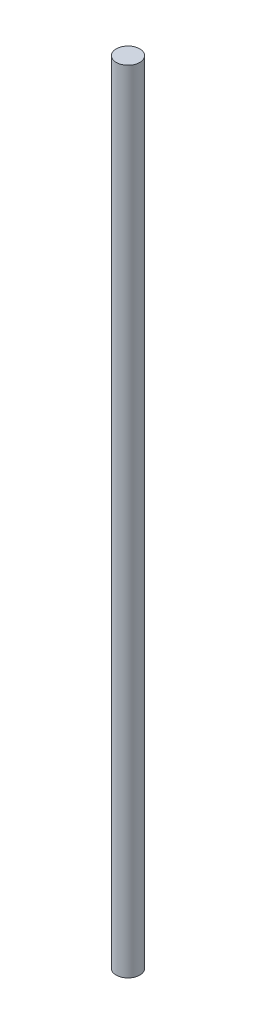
ISO-10303-21;
HEADER;
FILE_DESCRIPTION(('STEP AP214'),'2;1');
FILE_NAME('part.step','',(''),(''),'','','');
FILE_SCHEMA(('AUTOMOTIVE_DESIGN { 1 0 10303 214 1 1 1 1 }'));
ENDSEC;
DATA;
#1=APPLICATION_CONTEXT('core data for automotive mechanical design processes');
#2=APPLICATION_PROTOCOL_DEFINITION('international standard','automotive_design',2000,#1);
#3=PRODUCT_CONTEXT('',#1,'mechanical');
#4=PRODUCT('Part','Part','',(#3));
#5=PRODUCT_RELATED_PRODUCT_CATEGORY('part','',(#4));
#6=PRODUCT_DEFINITION_FORMATION('','',#4);
#7=PRODUCT_DEFINITION_CONTEXT('part definition',#1,'design');
#8=PRODUCT_DEFINITION('design','',#6,#7);
#9=PRODUCT_DEFINITION_SHAPE('','',#8);
#10=(LENGTH_UNIT() NAMED_UNIT(*) SI_UNIT(.MILLI.,.METRE.));
#11=(NAMED_UNIT(*) PLANE_ANGLE_UNIT() SI_UNIT($,.RADIAN.));
#12=(NAMED_UNIT(*) SI_UNIT($,.STERADIAN.) SOLID_ANGLE_UNIT());
#13=UNCERTAINTY_MEASURE_WITH_UNIT(LENGTH_MEASURE(1.E-05),#10,'distance_accuracy_value','');
#14=(GEOMETRIC_REPRESENTATION_CONTEXT(3) GLOBAL_UNCERTAINTY_ASSIGNED_CONTEXT((#13)) GLOBAL_UNIT_ASSIGNED_CONTEXT((#10,
#11,#12)) REPRESENTATION_CONTEXT('',''));
#15=CARTESIAN_POINT('',(0.,0.,0.));
#16=DIRECTION('',(0.,0.,1.));
#17=DIRECTION('',(1.,0.,0.));
#18=AXIS2_PLACEMENT_3D('',#15,#16,#17);
#19=CARTESIAN_POINT('',(0.,399.,0.));
#20=DIRECTION('',(0.,-1.,0.));
#21=DIRECTION('',(0.,0.,-1.));
#22=AXIS2_PLACEMENT_3D('',#19,#20,#21);
#23=CYLINDRICAL_SURFACE('',#22,5.95);
#24=CARTESIAN_POINT('',(0.,399.,0.));
#25=DIRECTION('',(0.,1.,0.));
#26=DIRECTION('',(0.,0.,1.));
#27=AXIS2_PLACEMENT_3D('',#24,#25,#26);
#28=CIRCLE('',#27,5.95);
#29=CARTESIAN_POINT('',(0.,399.,5.95));
#30=VERTEX_POINT('',#29);
#31=EDGE_CURVE('E10',#30,#30,#28,.T.);
#32=ORIENTED_EDGE('',*,*,#31,.F.);
#33=EDGE_LOOP('',(#32));
#34=FACE_BOUND('',#33,.T.);
#35=CARTESIAN_POINT('',(0.,0.,0.));
#36=DIRECTION('',(0.,1.,0.));
#37=DIRECTION('',(0.,0.,1.));
#38=AXIS2_PLACEMENT_3D('',#35,#36,#37);
#39=CIRCLE('',#38,5.95);
#40=CARTESIAN_POINT('',(0.,0.,5.95));
#41=VERTEX_POINT('',#40);
#42=EDGE_CURVE('E46',#41,#41,#39,.T.);
#43=ORIENTED_EDGE('',*,*,#42,.T.);
#44=EDGE_LOOP('',(#43));
#45=FACE_BOUND('',#44,.T.);
#46=ADVANCED_FACE('F43',(#34,#45),#23,.T.);
#47=CARTESIAN_POINT('',(0.,399.,0.));
#48=DIRECTION('',(0.,1.,0.));
#49=DIRECTION('',(0.,0.,1.));
#50=AXIS2_PLACEMENT_3D('',#47,#48,#49);
#51=PLANE('',#50);
#52=ORIENTED_EDGE('',*,*,#31,.T.);
#53=EDGE_LOOP('',(#52));
#54=FACE_BOUND('',#53,.T.);
#55=ADVANCED_FACE('F60',(#54),#51,.T.);
#56=CARTESIAN_POINT('',(0.,0.,0.));
#57=DIRECTION('',(0.,1.,0.));
#58=DIRECTION('',(0.,0.,1.));
#59=AXIS2_PLACEMENT_3D('',#56,#57,#58);
#60=PLANE('',#59);
#61=ORIENTED_EDGE('',*,*,#42,.F.);
#62=EDGE_LOOP('',(#61));
#63=FACE_BOUND('',#62,.T.);
#64=ADVANCED_FACE('F58',(#63),#60,.F.);
#65=CLOSED_SHELL('',(#46,#55,#64));
#66=MANIFOLD_SOLID_BREP('B2',#65);
#67=ADVANCED_BREP_SHAPE_REPRESENTATION('',(#18,#66),#14);
#68=SHAPE_DEFINITION_REPRESENTATION(#9,#67);
ENDSEC;
END-ISO-10303-21;
